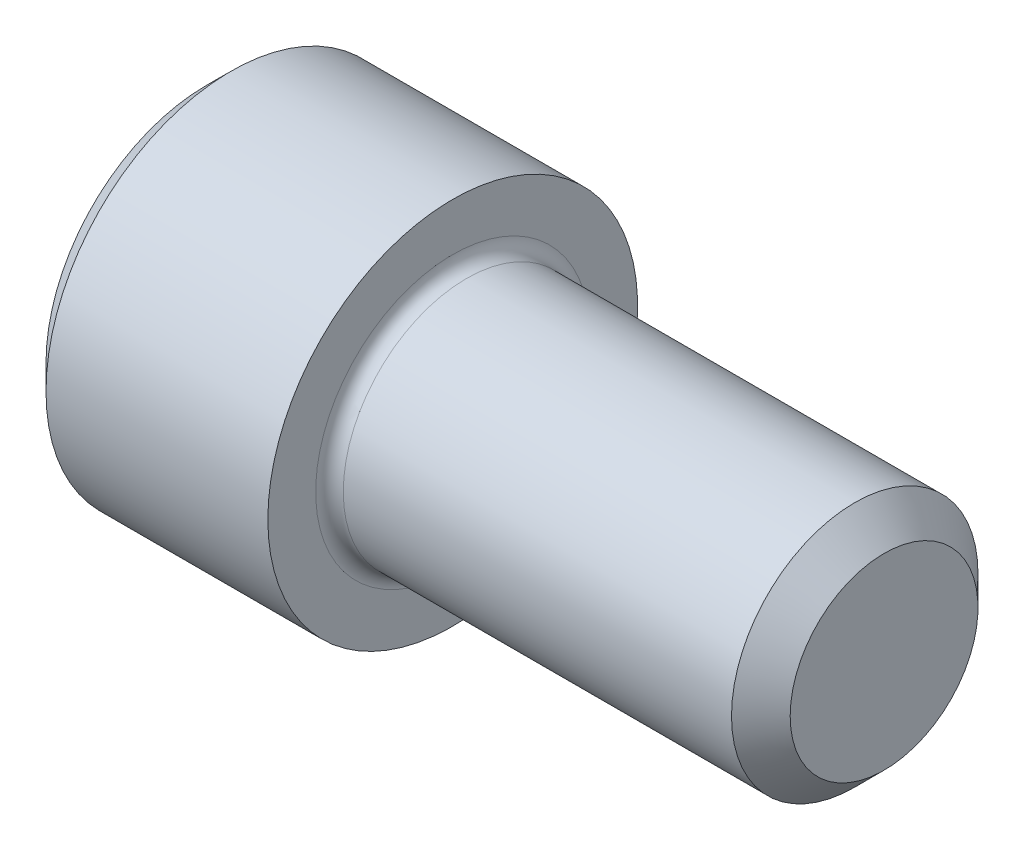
ISO-10303-21;
HEADER;
FILE_DESCRIPTION(('STEP AP214'),'2;1');
FILE_NAME('part.step','',(''),(''),'','','');
FILE_SCHEMA(('AUTOMOTIVE_DESIGN { 1 0 10303 214 1 1 1 1 }'));
ENDSEC;
DATA;
#1=APPLICATION_CONTEXT('core data for automotive mechanical design processes');
#2=APPLICATION_PROTOCOL_DEFINITION('international standard','automotive_design',2000,#1);
#3=PRODUCT_CONTEXT('',#1,'mechanical');
#4=PRODUCT('Part','Part','',(#3));
#5=PRODUCT_RELATED_PRODUCT_CATEGORY('part','',(#4));
#6=PRODUCT_DEFINITION_FORMATION('','',#4);
#7=PRODUCT_DEFINITION_CONTEXT('part definition',#1,'design');
#8=PRODUCT_DEFINITION('design','',#6,#7);
#9=PRODUCT_DEFINITION_SHAPE('','',#8);
#10=(LENGTH_UNIT() NAMED_UNIT(*) SI_UNIT(.MILLI.,.METRE.));
#11=(NAMED_UNIT(*) PLANE_ANGLE_UNIT() SI_UNIT($,.RADIAN.));
#12=(NAMED_UNIT(*) SI_UNIT($,.STERADIAN.) SOLID_ANGLE_UNIT());
#13=UNCERTAINTY_MEASURE_WITH_UNIT(LENGTH_MEASURE(1.E-05),#10,'distance_accuracy_value','');
#14=(GEOMETRIC_REPRESENTATION_CONTEXT(3) GLOBAL_UNCERTAINTY_ASSIGNED_CONTEXT((#13)) GLOBAL_UNIT_ASSIGNED_CONTEXT((#10,
#11,#12)) REPRESENTATION_CONTEXT('',''));
#15=CARTESIAN_POINT('',(0.,0.,0.));
#16=DIRECTION('',(0.,0.,1.));
#17=DIRECTION('',(1.,0.,0.));
#18=AXIS2_PLACEMENT_3D('',#15,#16,#17);
#19=CARTESIAN_POINT('',(0.,0.,0.));
#20=DIRECTION('',(-1.,0.,0.));
#21=DIRECTION('',(0.,0.,1.));
#22=AXIS2_PLACEMENT_3D('',#19,#20,#21);
#23=PLANE('',#22);
#24=DIRECTION('',(0.,-0.499999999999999,0.866025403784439));
#25=VECTOR('',#24,1.);
#26=CARTESIAN_POINT('',(0.,2.7496306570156,0.));
#27=LINE('',#26,#25);
#28=CARTESIAN_POINT('',(0.,2.7496306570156,0.));
#29=VERTEX_POINT('',#28);
#30=CARTESIAN_POINT('',(0.,1.3748153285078,2.38125));
#31=VERTEX_POINT('',#30);
#32=EDGE_CURVE('E114',#29,#31,#27,.T.);
#33=ORIENTED_EDGE('',*,*,#32,.T.);
#34=DIRECTION('',(0.,1.,0.));
#35=VECTOR('',#34,1.);
#36=CARTESIAN_POINT('',(0.,-1.37481532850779,2.38125));
#37=LINE('',#36,#35);
#38=CARTESIAN_POINT('',(0.,-1.37481532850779,2.38125));
#39=VERTEX_POINT('',#38);
#40=EDGE_CURVE('E103',#39,#31,#37,.T.);
#41=ORIENTED_EDGE('',*,*,#40,.F.);
#42=DIRECTION('',(0.,-0.500000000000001,-0.866025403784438));
#43=VECTOR('',#42,1.);
#44=CARTESIAN_POINT('',(0.,-1.37481532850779,2.38125));
#45=LINE('',#44,#43);
#46=CARTESIAN_POINT('',(0.,-2.74963065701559,0.));
#47=VERTEX_POINT('',#46);
#48=EDGE_CURVE('E113',#39,#47,#45,.T.);
#49=ORIENTED_EDGE('',*,*,#48,.T.);
#50=DIRECTION('',(0.,0.499999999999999,-0.86602540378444));
#51=VECTOR('',#50,1.);
#52=CARTESIAN_POINT('',(0.,-2.74963065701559,0.));
#53=LINE('',#52,#51);
#54=CARTESIAN_POINT('',(0.,-1.3748153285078,-2.38125));
#55=VERTEX_POINT('',#54);
#56=EDGE_CURVE('E128',#47,#55,#53,.T.);
#57=ORIENTED_EDGE('',*,*,#56,.T.);
#58=DIRECTION('',(0.,-1.,0.));
#59=VECTOR('',#58,1.);
#60=CARTESIAN_POINT('',(0.,1.3748153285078,-2.38125));
#61=LINE('',#60,#59);
#62=CARTESIAN_POINT('',(0.,1.3748153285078,-2.38125));
#63=VERTEX_POINT('',#62);
#64=EDGE_CURVE('E131',#63,#55,#61,.T.);
#65=ORIENTED_EDGE('',*,*,#64,.F.);
#66=DIRECTION('',(0.,-0.500000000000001,-0.866025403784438));
#67=VECTOR('',#66,1.);
#68=CARTESIAN_POINT('',(0.,2.7496306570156,0.));
#69=LINE('',#68,#67);
#70=EDGE_CURVE('E123',#29,#63,#69,.T.);
#71=ORIENTED_EDGE('',*,*,#70,.F.);
#72=EDGE_LOOP('',(#33,#41,#49,#57,#65,#71));
#73=FACE_BOUND('',#72,.T.);
#74=CARTESIAN_POINT('',(0.,0.,0.));
#75=DIRECTION('',(-1.,0.,0.));
#76=DIRECTION('',(0.,0.,1.));
#77=AXIS2_PLACEMENT_3D('',#74,#75,#76);
#78=CIRCLE('',#77,4.12749999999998);
#79=CARTESIAN_POINT('',(0.,0.,4.12749999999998));
#80=VERTEX_POINT('',#79);
#81=EDGE_CURVE('E170',#80,#80,#78,.T.);
#82=ORIENTED_EDGE('',*,*,#81,.T.);
#83=EDGE_LOOP('',(#82));
#84=FACE_BOUND('',#83,.T.);
#85=ADVANCED_FACE('F30',(#73,#84),#23,.T.);
#86=CARTESIAN_POINT('',(17.4625,2.41935,0.));
#87=DIRECTION('',(1.,0.,0.));
#88=DIRECTION('',(0.,0.,-1.));
#89=AXIS2_PLACEMENT_3D('',#86,#87,#88);
#90=PLANE('',#89);
#91=CARTESIAN_POINT('',(17.4625,0.,0.));
#92=DIRECTION('',(-1.,0.,0.));
#93=DIRECTION('',(0.,0.,1.));
#94=AXIS2_PLACEMENT_3D('',#91,#92,#93);
#95=CIRCLE('',#94,2.41935);
#96=CARTESIAN_POINT('',(17.4625,0.,2.41935));
#97=VERTEX_POINT('',#96);
#98=EDGE_CURVE('E183',#97,#97,#95,.T.);
#99=ORIENTED_EDGE('',*,*,#98,.F.);
#100=EDGE_LOOP('',(#99));
#101=FACE_BOUND('',#100,.T.);
#102=ADVANCED_FACE('F32',(#101),#90,.T.);
#103=CARTESIAN_POINT('',(17.4625,0.,0.));
#104=DIRECTION('',(-1.,0.,0.));
#105=DIRECTION('',(0.,0.,1.));
#106=AXIS2_PLACEMENT_3D('',#103,#104,#105);
#107=CONICAL_SURFACE('',#106,2.41935,0.785398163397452);
#108=CARTESIAN_POINT('',(16.70685,0.,0.));
#109=DIRECTION('',(-1.,0.,0.));
#110=DIRECTION('',(0.,0.,1.));
#111=AXIS2_PLACEMENT_3D('',#108,#109,#110);
#112=CIRCLE('',#111,3.175);
#113=CARTESIAN_POINT('',(16.70685,0.,3.175));
#114=VERTEX_POINT('',#113);
#115=EDGE_CURVE('E180',#114,#114,#112,.T.);
#116=ORIENTED_EDGE('',*,*,#115,.F.);
#117=EDGE_LOOP('',(#116));
#118=FACE_BOUND('',#117,.T.);
#119=ORIENTED_EDGE('',*,*,#98,.T.);
#120=EDGE_LOOP('',(#119));
#121=FACE_BOUND('',#120,.T.);
#122=ADVANCED_FACE('F212',(#118,#121),#107,.T.);
#123=CARTESIAN_POINT('',(-31.75,0.,0.));
#124=DIRECTION('',(-1.,0.,0.));
#125=DIRECTION('',(0.,0.,1.));
#126=AXIS2_PLACEMENT_3D('',#123,#124,#125);
#127=CYLINDRICAL_SURFACE('',#126,3.175);
#128=CARTESIAN_POINT('',(6.70560000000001,0.,0.));
#129=DIRECTION('',(1.,0.,0.));
#130=DIRECTION('',(0.,0.,-1.));
#131=AXIS2_PLACEMENT_3D('',#128,#129,#130);
#132=CIRCLE('',#131,3.175);
#133=CARTESIAN_POINT('',(6.70560000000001,0.,-3.175));
#134=VERTEX_POINT('',#133);
#135=EDGE_CURVE('E11',#134,#134,#132,.T.);
#136=ORIENTED_EDGE('',*,*,#135,.T.);
#137=EDGE_LOOP('',(#136));
#138=FACE_BOUND('',#137,.T.);
#139=ORIENTED_EDGE('',*,*,#115,.T.);
#140=EDGE_LOOP('',(#139));
#141=FACE_BOUND('',#140,.T.);
#142=ADVANCED_FACE('F219',(#138,#141),#127,.T.);
#143=CARTESIAN_POINT('',(6.35000000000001,4.7625,0.));
#144=DIRECTION('',(1.,0.,0.));
#145=DIRECTION('',(0.,0.,-1.));
#146=AXIS2_PLACEMENT_3D('',#143,#144,#145);
#147=PLANE('',#146);
#148=CARTESIAN_POINT('',(6.35000000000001,0.,0.));
#149=DIRECTION('',(1.,0.,0.));
#150=DIRECTION('',(0.,0.,-1.));
#151=AXIS2_PLACEMENT_3D('',#148,#149,#150);
#152=CIRCLE('',#151,3.5306);
#153=CARTESIAN_POINT('',(6.35000000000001,0.,-3.5306));
#154=VERTEX_POINT('',#153);
#155=EDGE_CURVE('E38',#154,#154,#152,.F.);
#156=ORIENTED_EDGE('',*,*,#155,.T.);
#157=EDGE_LOOP('',(#156));
#158=FACE_BOUND('',#157,.T.);
#159=CARTESIAN_POINT('',(6.35000000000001,0.,0.));
#160=DIRECTION('',(-1.,0.,0.));
#161=DIRECTION('',(0.,0.,1.));
#162=AXIS2_PLACEMENT_3D('',#159,#160,#161);
#163=CIRCLE('',#162,4.7625);
#164=CARTESIAN_POINT('',(6.35000000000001,0.,4.7625));
#165=VERTEX_POINT('',#164);
#166=EDGE_CURVE('E177',#165,#165,#163,.T.);
#167=ORIENTED_EDGE('',*,*,#166,.F.);
#168=EDGE_LOOP('',(#167));
#169=FACE_BOUND('',#168,.T.);
#170=ADVANCED_FACE('F188',(#158,#169),#147,.T.);
#171=CARTESIAN_POINT('',(-31.75,0.,0.));
#172=DIRECTION('',(-1.,0.,0.));
#173=DIRECTION('',(0.,0.,1.));
#174=AXIS2_PLACEMENT_3D('',#171,#172,#173);
#175=CYLINDRICAL_SURFACE('',#174,4.7625);
#176=ORIENTED_EDGE('',*,*,#166,.T.);
#177=EDGE_LOOP('',(#176));
#178=FACE_BOUND('',#177,.T.);
#179=CARTESIAN_POINT('',(0.635000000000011,0.,0.));
#180=DIRECTION('',(-1.,0.,0.));
#181=DIRECTION('',(0.,0.,1.));
#182=AXIS2_PLACEMENT_3D('',#179,#180,#181);
#183=CIRCLE('',#182,4.7625);
#184=CARTESIAN_POINT('',(0.635000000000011,0.,4.7625));
#185=VERTEX_POINT('',#184);
#186=EDGE_CURVE('E174',#185,#185,#183,.T.);
#187=ORIENTED_EDGE('',*,*,#186,.F.);
#188=EDGE_LOOP('',(#187));
#189=FACE_BOUND('',#188,.T.);
#190=ADVANCED_FACE('F203',(#178,#189),#175,.T.);
#191=CARTESIAN_POINT('',(0.,0.,0.));
#192=DIRECTION('',(1.,0.,0.));
#193=DIRECTION('',(0.,0.,-1.));
#194=AXIS2_PLACEMENT_3D('',#191,#192,#193);
#195=CONICAL_SURFACE('',#194,4.12749999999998,0.785398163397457);
#196=ORIENTED_EDGE('',*,*,#186,.T.);
#197=EDGE_LOOP('',(#196));
#198=FACE_BOUND('',#197,.T.);
#199=ORIENTED_EDGE('',*,*,#81,.F.);
#200=EDGE_LOOP('',(#199));
#201=FACE_BOUND('',#200,.T.);
#202=ADVANCED_FACE('F193',(#198,#201),#195,.T.);
#203=CARTESIAN_POINT('',(6.70560000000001,0.,0.));
#204=DIRECTION('',(1.,0.,0.));
#205=DIRECTION('',(0.,0.,-1.));
#206=AXIS2_PLACEMENT_3D('',#203,#204,#205);
#207=TOROIDAL_SURFACE('',#206,3.5306,0.3556);
#208=ORIENTED_EDGE('',*,*,#135,.F.);
#209=EDGE_LOOP('',(#208));
#210=FACE_BOUND('',#209,.T.);
#211=ORIENTED_EDGE('',*,*,#155,.F.);
#212=EDGE_LOOP('',(#211));
#213=FACE_BOUND('',#212,.T.);
#214=ADVANCED_FACE('F191',(#210,#213),#207,.F.);
#215=CARTESIAN_POINT('',(3.048,2.7496306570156,0.));
#216=DIRECTION('',(0.,-0.866025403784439,-0.499999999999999));
#217=DIRECTION('',(0.,0.499999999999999,-0.86602540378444));
#218=AXIS2_PLACEMENT_3D('',#215,#216,#217);
#219=PLANE('',#218);
#220=ORIENTED_EDGE('',*,*,#32,.F.);
#221=DIRECTION('',(-1.,0.,0.));
#222=VECTOR('',#221,1.);
#223=CARTESIAN_POINT('',(3.048,2.7496306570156,0.));
#224=LINE('',#223,#222);
#225=CARTESIAN_POINT('',(3.048,2.7496306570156,0.));
#226=VERTEX_POINT('',#225);
#227=EDGE_CURVE('E155',#226,#29,#224,.T.);
#228=ORIENTED_EDGE('',*,*,#227,.F.);
#229=DIRECTION('',(0.,-0.499999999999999,0.866025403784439));
#230=VECTOR('',#229,1.);
#231=CARTESIAN_POINT('',(3.048,2.7496306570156,0.));
#232=LINE('',#231,#230);
#233=CARTESIAN_POINT('',(3.04800000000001,2.0622229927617,1.190625));
#234=VERTEX_POINT('',#233);
#235=EDGE_CURVE('E45',#226,#234,#232,.T.);
#236=ORIENTED_EDGE('',*,*,#235,.T.);
#237=CARTESIAN_POINT('',(3.048,1.3748153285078,2.38125));
#238=VERTEX_POINT('',#237);
#239=EDGE_CURVE('E118',#234,#238,#232,.T.);
#240=ORIENTED_EDGE('',*,*,#239,.T.);
#241=DIRECTION('',(-1.,0.,0.));
#242=VECTOR('',#241,1.);
#243=CARTESIAN_POINT('',(3.048,1.3748153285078,2.38125));
#244=LINE('',#243,#242);
#245=EDGE_CURVE('E107',#238,#31,#244,.T.);
#246=ORIENTED_EDGE('',*,*,#245,.T.);
#247=EDGE_LOOP('',(#220,#228,#236,#240,#246));
#248=FACE_BOUND('',#247,.T.);
#249=ADVANCED_FACE('F116',(#248),#219,.T.);
#250=CARTESIAN_POINT('',(3.048,-1.37481532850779,2.38125));
#251=DIRECTION('',(0.,0.,1.));
#252=DIRECTION('',(0.,-1.,0.));
#253=AXIS2_PLACEMENT_3D('',#250,#251,#252);
#254=PLANE('',#253);
#255=ORIENTED_EDGE('',*,*,#40,.T.);
#256=ORIENTED_EDGE('',*,*,#245,.F.);
#257=DIRECTION('',(0.,1.,0.));
#258=VECTOR('',#257,1.);
#259=CARTESIAN_POINT('',(3.048,-1.37481532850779,2.38125));
#260=LINE('',#259,#258);
#261=CARTESIAN_POINT('',(3.048,0.,2.38125));
#262=VERTEX_POINT('',#261);
#263=EDGE_CURVE('E135',#262,#238,#260,.T.);
#264=ORIENTED_EDGE('',*,*,#263,.F.);
#265=CARTESIAN_POINT('',(3.048,-1.37481532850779,2.38125));
#266=VERTEX_POINT('',#265);
#267=EDGE_CURVE('E136',#266,#262,#260,.T.);
#268=ORIENTED_EDGE('',*,*,#267,.F.);
#269=DIRECTION('',(-1.,0.,0.));
#270=VECTOR('',#269,1.);
#271=CARTESIAN_POINT('',(3.048,-1.37481532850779,2.38125));
#272=LINE('',#271,#270);
#273=EDGE_CURVE('E109',#266,#39,#272,.T.);
#274=ORIENTED_EDGE('',*,*,#273,.T.);
#275=EDGE_LOOP('',(#255,#256,#264,#268,#274));
#276=FACE_BOUND('',#275,.T.);
#277=ADVANCED_FACE('F105',(#276),#254,.F.);
#278=CARTESIAN_POINT('',(3.048,-1.37481532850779,2.38125));
#279=DIRECTION('',(0.,0.866025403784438,-0.500000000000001));
#280=DIRECTION('',(0.,0.500000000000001,0.866025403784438));
#281=AXIS2_PLACEMENT_3D('',#278,#279,#280);
#282=PLANE('',#281);
#283=ORIENTED_EDGE('',*,*,#48,.F.);
#284=ORIENTED_EDGE('',*,*,#273,.F.);
#285=DIRECTION('',(0.,-0.500000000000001,-0.866025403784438));
#286=VECTOR('',#285,1.);
#287=CARTESIAN_POINT('',(3.048,-1.37481532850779,2.38125));
#288=LINE('',#287,#286);
#289=CARTESIAN_POINT('',(3.048,-2.06222299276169,1.190625));
#290=VERTEX_POINT('',#289);
#291=EDGE_CURVE('E140',#266,#290,#288,.T.);
#292=ORIENTED_EDGE('',*,*,#291,.T.);
#293=CARTESIAN_POINT('',(3.048,-2.74963065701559,0.));
#294=VERTEX_POINT('',#293);
#295=EDGE_CURVE('E139',#290,#294,#288,.T.);
#296=ORIENTED_EDGE('',*,*,#295,.T.);
#297=DIRECTION('',(-1.,0.,0.));
#298=VECTOR('',#297,1.);
#299=CARTESIAN_POINT('',(3.048,-2.74963065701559,0.));
#300=LINE('',#299,#298);
#301=EDGE_CURVE('E163',#294,#47,#300,.T.);
#302=ORIENTED_EDGE('',*,*,#301,.T.);
#303=EDGE_LOOP('',(#283,#284,#292,#296,#302));
#304=FACE_BOUND('',#303,.T.);
#305=ADVANCED_FACE('F271',(#304),#282,.T.);
#306=CARTESIAN_POINT('',(3.048,-2.74963065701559,0.));
#307=DIRECTION('',(0.,0.86602540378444,0.499999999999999));
#308=DIRECTION('',(0.,-0.499999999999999,0.86602540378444));
#309=AXIS2_PLACEMENT_3D('',#306,#307,#308);
#310=PLANE('',#309);
#311=ORIENTED_EDGE('',*,*,#56,.F.);
#312=ORIENTED_EDGE('',*,*,#301,.F.);
#313=DIRECTION('',(0.,0.499999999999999,-0.86602540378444));
#314=VECTOR('',#313,1.);
#315=CARTESIAN_POINT('',(3.048,-2.74963065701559,0.));
#316=LINE('',#315,#314);
#317=CARTESIAN_POINT('',(3.048,-2.06222299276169,-1.190625));
#318=VERTEX_POINT('',#317);
#319=EDGE_CURVE('E144',#294,#318,#316,.T.);
#320=ORIENTED_EDGE('',*,*,#319,.T.);
#321=CARTESIAN_POINT('',(3.048,-1.3748153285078,-2.38125));
#322=VERTEX_POINT('',#321);
#323=EDGE_CURVE('E143',#318,#322,#316,.T.);
#324=ORIENTED_EDGE('',*,*,#323,.T.);
#325=DIRECTION('',(-1.,0.,0.));
#326=VECTOR('',#325,1.);
#327=CARTESIAN_POINT('',(3.048,-1.3748153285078,-2.38125));
#328=LINE('',#327,#326);
#329=EDGE_CURVE('E160',#322,#55,#328,.T.);
#330=ORIENTED_EDGE('',*,*,#329,.T.);
#331=EDGE_LOOP('',(#311,#312,#320,#324,#330));
#332=FACE_BOUND('',#331,.T.);
#333=ADVANCED_FACE('F278',(#332),#310,.T.);
#334=CARTESIAN_POINT('',(3.048,1.3748153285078,-2.38125));
#335=DIRECTION('',(0.,0.,-1.));
#336=DIRECTION('',(0.,1.,0.));
#337=AXIS2_PLACEMENT_3D('',#334,#335,#336);
#338=PLANE('',#337);
#339=ORIENTED_EDGE('',*,*,#64,.T.);
#340=ORIENTED_EDGE('',*,*,#329,.F.);
#341=DIRECTION('',(0.,-1.,0.));
#342=VECTOR('',#341,1.);
#343=CARTESIAN_POINT('',(3.048,1.3748153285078,-2.38125));
#344=LINE('',#343,#342);
#345=CARTESIAN_POINT('',(3.048,0.,-2.38125));
#346=VERTEX_POINT('',#345);
#347=EDGE_CURVE('E147',#346,#322,#344,.T.);
#348=ORIENTED_EDGE('',*,*,#347,.F.);
#349=CARTESIAN_POINT('',(3.048,1.3748153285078,-2.38125));
#350=VERTEX_POINT('',#349);
#351=EDGE_CURVE('E148',#350,#346,#344,.T.);
#352=ORIENTED_EDGE('',*,*,#351,.F.);
#353=DIRECTION('',(-1.,0.,0.));
#354=VECTOR('',#353,1.);
#355=CARTESIAN_POINT('',(3.048,1.3748153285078,-2.38125));
#356=LINE('',#355,#354);
#357=EDGE_CURVE('E157',#350,#63,#356,.T.);
#358=ORIENTED_EDGE('',*,*,#357,.T.);
#359=EDGE_LOOP('',(#339,#340,#348,#352,#358));
#360=FACE_BOUND('',#359,.T.);
#361=ADVANCED_FACE('F286',(#360),#338,.F.);
#362=CARTESIAN_POINT('',(3.048,2.7496306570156,0.));
#363=DIRECTION('',(0.,0.866025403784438,-0.500000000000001));
#364=DIRECTION('',(0.,0.500000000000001,0.866025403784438));
#365=AXIS2_PLACEMENT_3D('',#362,#363,#364);
#366=PLANE('',#365);
#367=ORIENTED_EDGE('',*,*,#70,.T.);
#368=ORIENTED_EDGE('',*,*,#357,.F.);
#369=DIRECTION('',(0.,-0.500000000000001,-0.866025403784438));
#370=VECTOR('',#369,1.);
#371=CARTESIAN_POINT('',(3.048,2.7496306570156,0.));
#372=LINE('',#371,#370);
#373=CARTESIAN_POINT('',(3.048,2.0622229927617,-1.19062500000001));
#374=VERTEX_POINT('',#373);
#375=EDGE_CURVE('E151',#374,#350,#372,.T.);
#376=ORIENTED_EDGE('',*,*,#375,.F.);
#377=EDGE_CURVE('E152',#226,#374,#372,.T.);
#378=ORIENTED_EDGE('',*,*,#377,.F.);
#379=ORIENTED_EDGE('',*,*,#227,.T.);
#380=EDGE_LOOP('',(#367,#368,#376,#378,#379));
#381=FACE_BOUND('',#380,.T.);
#382=ADVANCED_FACE('F294',(#381),#366,.F.);
#383=CARTESIAN_POINT('',(3.048,1.3748153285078,2.38125));
#384=DIRECTION('',(-1.,0.,0.));
#385=DIRECTION('',(0.,0.,1.));
#386=AXIS2_PLACEMENT_3D('',#383,#384,#385);
#387=PLANE('',#386);
#388=CARTESIAN_POINT('',(3.04800000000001,0.,0.));
#389=DIRECTION('',(-1.,0.,0.));
#390=DIRECTION('',(0.,0.,1.));
#391=AXIS2_PLACEMENT_3D('',#388,#389,#390);
#392=CIRCLE('',#391,2.38125);
#393=EDGE_CURVE('E119',#290,#262,#392,.T.);
#394=ORIENTED_EDGE('',*,*,#393,.F.);
#395=ORIENTED_EDGE('',*,*,#291,.F.);
#396=ORIENTED_EDGE('',*,*,#267,.T.);
#397=EDGE_LOOP('',(#394,#395,#396));
#398=FACE_BOUND('',#397,.T.);
#399=ADVANCED_FACE('F302',(#398),#387,.T.);
#400=EDGE_CURVE('E353',#318,#290,#392,.T.);
#401=ORIENTED_EDGE('',*,*,#400,.F.);
#402=ORIENTED_EDGE('',*,*,#319,.F.);
#403=ORIENTED_EDGE('',*,*,#295,.F.);
#404=EDGE_LOOP('',(#401,#402,#403));
#405=FACE_BOUND('',#404,.T.);
#406=ADVANCED_FACE('F310',(#405),#387,.T.);
#407=EDGE_CURVE('E354',#346,#318,#392,.T.);
#408=ORIENTED_EDGE('',*,*,#407,.F.);
#409=ORIENTED_EDGE('',*,*,#347,.T.);
#410=ORIENTED_EDGE('',*,*,#323,.F.);
#411=EDGE_LOOP('',(#408,#409,#410));
#412=FACE_BOUND('',#411,.T.);
#413=ADVANCED_FACE('F318',(#412),#387,.T.);
#414=EDGE_CURVE('E355',#374,#346,#392,.T.);
#415=ORIENTED_EDGE('',*,*,#414,.F.);
#416=ORIENTED_EDGE('',*,*,#375,.T.);
#417=ORIENTED_EDGE('',*,*,#351,.T.);
#418=EDGE_LOOP('',(#415,#416,#417));
#419=FACE_BOUND('',#418,.T.);
#420=ADVANCED_FACE('F325',(#419),#387,.T.);
#421=EDGE_CURVE('E171',#234,#374,#392,.T.);
#422=ORIENTED_EDGE('',*,*,#421,.F.);
#423=ORIENTED_EDGE('',*,*,#235,.F.);
#424=ORIENTED_EDGE('',*,*,#377,.T.);
#425=EDGE_LOOP('',(#422,#423,#424));
#426=FACE_BOUND('',#425,.T.);
#427=ADVANCED_FACE('F332',(#426),#387,.T.);
#428=EDGE_CURVE('E167',#262,#234,#392,.T.);
#429=ORIENTED_EDGE('',*,*,#428,.F.);
#430=ORIENTED_EDGE('',*,*,#263,.T.);
#431=ORIENTED_EDGE('',*,*,#239,.F.);
#432=EDGE_LOOP('',(#429,#430,#431));
#433=FACE_BOUND('',#432,.T.);
#434=ADVANCED_FACE('F257',(#433),#387,.T.);
#435=CARTESIAN_POINT('',(3.04800000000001,0.,0.));
#436=DIRECTION('',(-1.,0.,0.));
#437=DIRECTION('',(0.,0.,1.));
#438=AXIS2_PLACEMENT_3D('',#435,#436,#437);
#439=CONICAL_SURFACE('',#438,2.38125,1.04719755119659);
#440=CARTESIAN_POINT('',(4.42281532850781,0.,0.));
#441=VERTEX_POINT('',#440);
#442=VERTEX_LOOP('',#441);
#443=FACE_BOUND('',#442,.T.);
#444=ORIENTED_EDGE('',*,*,#428,.T.);
#445=ORIENTED_EDGE('',*,*,#421,.T.);
#446=ORIENTED_EDGE('',*,*,#414,.T.);
#447=ORIENTED_EDGE('',*,*,#407,.T.);
#448=ORIENTED_EDGE('',*,*,#400,.T.);
#449=ORIENTED_EDGE('',*,*,#393,.T.);
#450=EDGE_LOOP('',(#444,#445,#446,#447,#448,#449));
#451=FACE_BOUND('',#450,.T.);
#452=ADVANCED_FACE('F253',(#443,#451),#439,.F.);
#453=CLOSED_SHELL('',(#85,#102,#122,#142,#170,#190,#202,#214,#249,#277,#305,#333,#361,#382,#399,
#406,#413,#420,#427,#434,#452));
#454=MANIFOLD_SOLID_BREP('B2',#453);
#455=ADVANCED_BREP_SHAPE_REPRESENTATION('',(#18,#454),#14);
#456=SHAPE_DEFINITION_REPRESENTATION(#9,#455);
ENDSEC;
END-ISO-10303-21;
